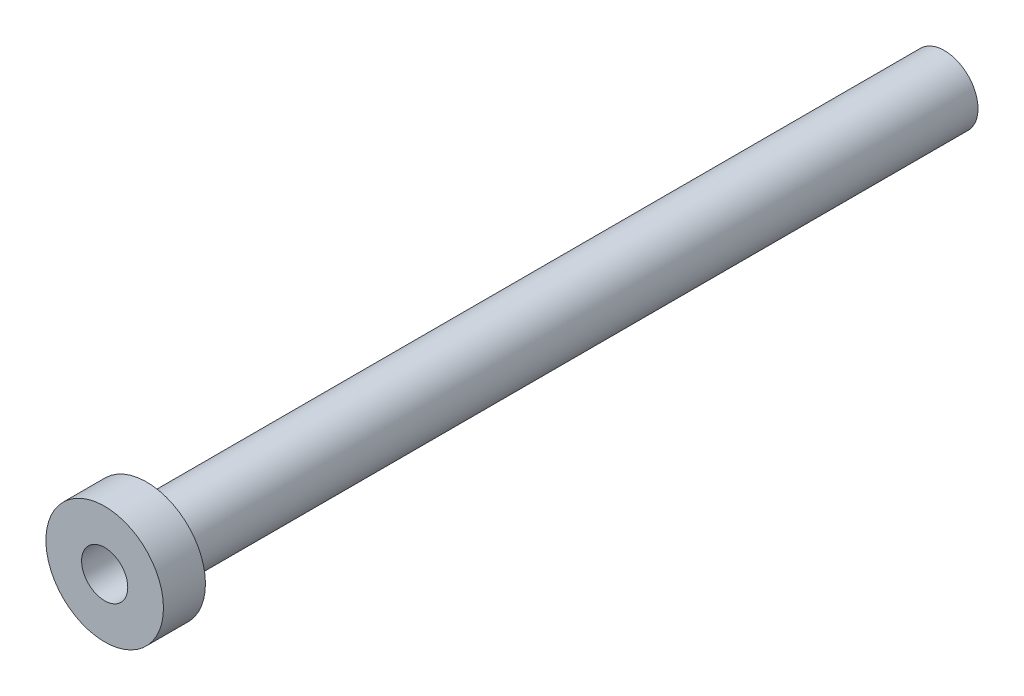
from build123d import *


with BuildPart() as part:
    # Sketch1 → Revolve1 (revolve)
    with BuildSketch(Plane(origin=(0, 0, 0), x_dir=(0, 0, -1), z_dir=(1, 0, 0)), mode=Mode.PRIVATE) as revolve1_sk:
        with BuildLine():
            Line((0, 7), (0, 2.5))
            Line((0, 2.5), (100, 2.5))
            Line((100, 2.5), (100, 4))
            Line((100, 4), (5.5, 4))
            ThreePointArc((5.5, 4), (5.146446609, 4.146446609), (5, 4.5))
            Line((5, 4.5), (5, 7))
            Line((5, 7), (0, 7))
        make_face()
    revolve(revolve1_sk.sketch.rotate(Axis((0, 0, 0), (0, 0, -1)), 90), axis=Axis((0, 0, 0), (0, 0, -1)))

    # Sketch2 → Cut-Revolve1 (revolve, cut)
    with BuildSketch(Plane(origin=(0, 0, 0), x_dir=(0, 0, -1), z_dir=(1, 0, 0)), mode=Mode.PRIVATE) as cut_revolve1_sk:
        Polygon((55, 2.5), (54.313130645, 2.75), (0, 2.75), (0, 2.5), align=None)
    revolve(cut_revolve1_sk.sketch.rotate(Axis((0, 0, 0), (0, 0, -1)), 90), axis=Axis((0, 0, 0), (0, 0, -1)), mode=Mode.SUBTRACT)


solid = part.part
